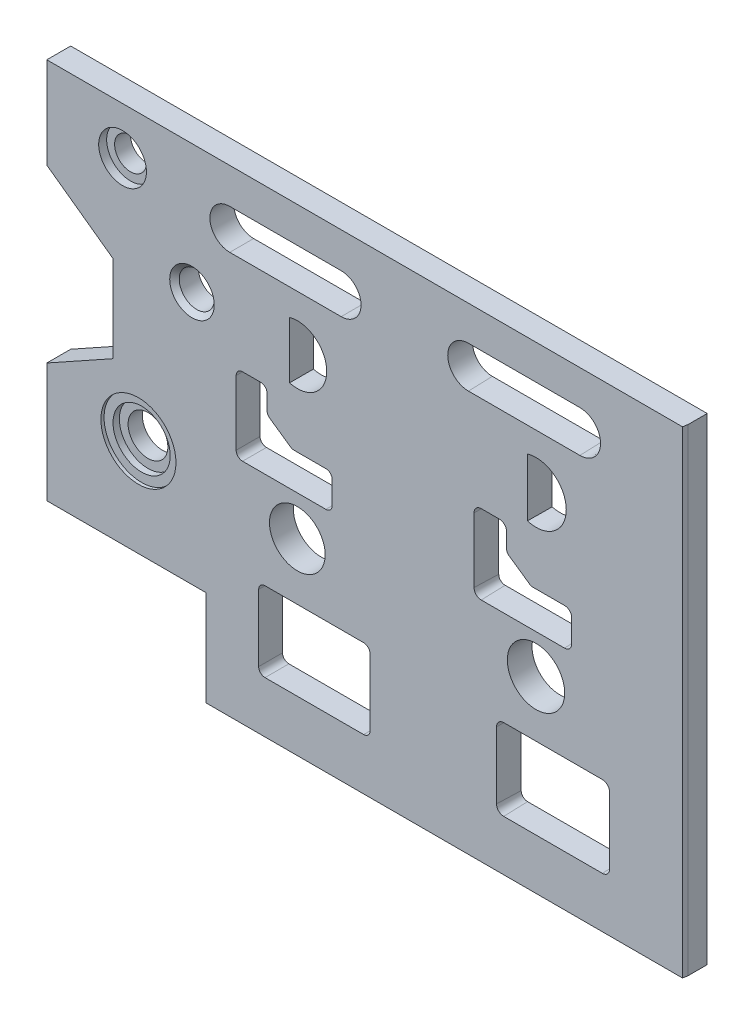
from build123d import *

# Parameters (mm, degrees)
SKETCH1_W                    = 400
SKETCH1_H                    = 300
BASE_EXTRUDE_DEPTH           = 15
SKETCH3_W                    = 100
SKETCH3_H                    = 60
CUT_EXTRUDE1_DEPTH           = 15
SKETCH5_R                    = 17.5
CUT_EXTRUDE2_DEPTH           = 15
SKETCH9_R                    = 17.5
CUT_EXTRUDE3_DEPTH           = 15
CUT_EXTRUDE3_DRAFT           = 2
CUT_EXTRUDE3_PROFILE_2_DEPTH = 15
CUT_EXTRUDE3_PROFILE_2_DRAFT = 2
CUT_EXTRUDE3_PROFILE_3_DEPTH = 15
CUT_EXTRUDE3_PROFILE_3_DRAFT = 2
CUT_EXTRUDE3_PROFILE_4_DEPTH = 15
CUT_EXTRUDE3_PROFILE_4_DRAFT = 2
CUT_EXTRUDE3_PROFILE_5_DEPTH = 15
CUT_EXTRUDE3_PROFILE_5_DRAFT = 2
SKETCH10_R                   = 10
SKETCH10_R_2                 = 11
CUT_EXTRUDE4_DEPTH           = 15
SKETCH11_R                   = 12.5
CUT_EXTRUDE5_DEPTH           = 15
SKETCH12_R                   = 15
CUT_EXTRUDE6_DEPTH           = 5
CHAMFER1_SIZE                = 3
SKETCH13_R                   = 17.970132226
CUT_EXTRUDE7_DEPTH           = 6
SKETCH14_R                   = 23.588666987
CUT_EXTRUDE8_DEPTH           = 2
CHAMFER2_SIZE                = 0.528980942
CHAMFER2_SIZE2               = 3


with BuildPart() as part:
    # Sketch1 → Base-Extrude (new body)
    with BuildSketch(Plane.XY):
        with Locations((200, 150)):
            Rectangle(SKETCH1_W, SKETCH1_H)
    extrude(amount=BASE_EXTRUDE_DEPTH)

    # Sketch3 → Cut-Extrude1 (cut)
    with BuildSketch(Plane(origin=(0, 0, 0), x_dir=(-1, 0, 0), z_dir=(0, 0, -1))):
        Polygon((0, 134.976525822), (-41.627543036, 158.13771518), (-41.627543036, 212.597809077), (0, 242.644757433), align=None)
        with Locations((-50, 30)):
            Rectangle(SKETCH3_W, SKETCH3_H)
    extrude(amount=-CUT_EXTRUDE1_DEPTH, mode=Mode.SUBTRACT)

    # Sketch5 → Cut-Extrude2 (cut)
    with BuildSketch(Plane(origin=(0, 0, 0), x_dir=(-1, 0, 0), z_dir=(0, 0, -1))):
        with Locations((-157.434743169, 118.075117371)):
            Circle(SKETCH5_R)
        with BuildLine():
            Line((-119.004694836, 187.704225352), (-119.004694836, 147.015649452))
            ThreePointArc((-119.004694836, 147.015649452), (-120.176267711, 144.187222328), (-123.004694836, 143.015649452))
            Line((-123.004694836, 143.015649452), (-175.342723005, 143.015649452))
            ThreePointArc((-175.342723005, 143.015649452), (-178.171150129, 144.187222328), (-179.342723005, 147.015649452))
            Line((-179.342723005, 147.015649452), (-179.342723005, 161.169014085))
            ThreePointArc((-179.342723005, 161.169014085), (-178.171150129, 163.997441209), (-175.342723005, 165.169014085))
            Line((-175.342723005, 165.169014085), (-155.434743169, 165.169014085))
            ThreePointArc((-155.434743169, 165.169014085), (-154.237764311, 165.352308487), (-153.150485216, 165.885393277))
            Line((-153.150485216, 165.885393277), (-140.125757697, 174.946073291))
            ThreePointArc((-140.125757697, 174.946073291), (-138.864805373, 176.377267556), (-138.410015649, 178.229694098))
            Line((-138.410015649, 178.229694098), (-138.410015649, 187.704225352))
            ThreePointArc((-138.410015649, 187.704225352), (-137.238442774, 190.532652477), (-134.410015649, 191.704225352))
            Line((-134.410015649, 191.704225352), (-123.004694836, 191.704225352))
            ThreePointArc((-123.004694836, 191.704225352), (-120.176267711, 190.532652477), (-119.004694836, 187.704225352))
        make_face()
        with BuildLine():
            Line((-137.129890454, 82.316118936), (-199.129890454, 82.316118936))
            ThreePointArc((-199.129890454, 82.316118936), (-201.958317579, 81.144546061), (-203.129890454, 78.316118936))
            Line((-203.129890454, 78.316118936), (-203.129890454, 36.316118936))
            ThreePointArc((-203.129890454, 36.316118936), (-201.958317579, 33.487691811), (-199.129890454, 32.316118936))
            Line((-199.129890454, 32.316118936), (-137.129890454, 32.316118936))
            ThreePointArc((-137.129890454, 32.316118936), (-134.301463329, 33.487691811), (-133.129890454, 36.316118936))
            Line((-133.129890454, 36.316118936), (-133.129890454, 78.316118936))
            ThreePointArc((-133.129890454, 78.316118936), (-134.301463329, 81.144546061), (-137.129890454, 82.316118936))
        make_face()
        with BuildLine():
            Line((-152.547730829, 236.089494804), (-152.547730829, 200.436326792))
            ThreePointArc((-152.547730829, 200.436326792), (-175.919060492, 218.262910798), (-152.547730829, 236.089494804))
        make_face()
        with BuildLine():
            Line((-114.976525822, 277.699530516), (-184.976525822, 277.699530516))
            ThreePointArc((-184.976525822, 277.699530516), (-197.476525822, 265.199530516), (-184.976525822, 252.699530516))
            Line((-184.976525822, 252.699530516), (-114.976525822, 252.699530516))
            ThreePointArc((-114.976525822, 252.699530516), (-102.476525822, 265.199530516), (-114.976525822, 277.699530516))
        make_face()
    extrude(amount=-CUT_EXTRUDE2_DEPTH, mode=Mode.SUBTRACT)


with BuildPart() as cut_extrude3_tool:
    # Sketch9 → Cut-Extrude3 (with draft: the straight prism first)
    with BuildSketch(Plane(origin=(8.022369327, 31.352349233, 0), x_dir=(-1, 0, 0), z_dir=(0, 0, -1))):
        with Locations((-299.412373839, 86.722768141)):
            Circle(SKETCH9_R)
    extrude(amount=-CUT_EXTRUDE3_DEPTH)
    # Cut-Extrude3: the draft: its side faces are tilted about the plane it starts from
    cut_extrude3_sides = [cut_extrude3_tool.faces().sort_by_distance(p)[0] for p in [
        (324.934743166, 118.075117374, 7.5),
    ]]
    draft(cut_extrude3_sides, Plane(origin=(8.022369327, 31.352349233, 0), x_dir=(-1, 0, 0), z_dir=(0, 0, -1)), CUT_EXTRUDE3_DRAFT)


with BuildPart() as part_1:
    add(part.part)

    # Cut-Extrude3: cut by cut_extrude3_tool
    add(cut_extrude3_tool.part, mode=Mode.SUBTRACT)


with BuildPart() as cut_extrude3_profile_2_tool:
    # Sketch9 → Cut-Extrude3 profile 2 (with draft: the straight prism first)
    with BuildSketch(Plane(origin=(8.022369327, 31.352349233, 0), x_dir=(-1, 0, 0), z_dir=(0, 0, -1))):
        with BuildLine():
            ThreePointArc((-260.982325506, 156.351876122), (-262.153898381, 159.180303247), (-264.982325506, 160.351876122))
            Line((-264.982325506, 160.351876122), (-276.387646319, 160.351876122))
            ThreePointArc((-276.387646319, 160.351876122), (-279.216073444, 159.180303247), (-280.387646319, 156.351876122))
            Line((-280.387646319, 156.351876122), (-280.387646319, 146.877344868))
            ThreePointArc((-280.387646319, 146.877344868), (-280.842436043, 145.024918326), (-282.103388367, 143.593724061))
            Line((-282.103388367, 143.593724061), (-295.128115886, 134.533044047))
            ThreePointArc((-295.128115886, 134.533044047), (-296.215394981, 133.999959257), (-297.412373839, 133.816664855))
            Line((-297.412373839, 133.816664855), (-317.320353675, 133.816664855))
            ThreePointArc((-317.320353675, 133.816664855), (-320.148780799, 132.645091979), (-321.320353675, 129.816664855))
            Line((-321.320353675, 129.816664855), (-321.320353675, 115.663300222))
            ThreePointArc((-321.320353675, 115.663300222), (-320.148780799, 112.834873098), (-317.320353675, 111.663300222))
            Line((-317.320353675, 111.663300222), (-264.982325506, 111.663300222))
            ThreePointArc((-264.982325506, 111.663300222), (-262.153898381, 112.834873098), (-260.982325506, 115.663300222))
            Line((-260.982325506, 115.663300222), (-260.982325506, 156.351876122))
        make_face()
    extrude(amount=-CUT_EXTRUDE3_PROFILE_2_DEPTH)
    # Cut-Extrude3 profile 2: the draft: its side faces are tilted about the plane it starts from
    cut_extrude3_profile_2_sides = [cut_extrude3_profile_2_tool.faces().sort_by_distance(p)[0] for p in [
        (270.176267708, 190.53265248, 7.5),
        (278.70735524, 191.704225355, 7.5),
        (287.238442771, 190.53265248, 7.5),
        (288.410015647, 182.966959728, 7.5),
        (288.86480537, 176.377267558, 7.5),
        (296.638121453, 170.415733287, 7.5),
        (304.237764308, 165.35230849, 7.5),
        (315.388733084, 165.169014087, 7.5),
        (328.171150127, 163.997441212, 7.5),
        (329.342723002, 154.092331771, 7.5),
        (328.171150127, 144.18722233, 7.5),
        (299.173708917, 143.015649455, 7.5),
        (270.176267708, 144.18722233, 7.5),
        (269.004694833, 167.359937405, 7.5),
    ]]
    draft(cut_extrude3_profile_2_sides, Plane(origin=(8.022369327, 31.352349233, 0), x_dir=(-1, 0, 0), z_dir=(0, 0, -1)), CUT_EXTRUDE3_PROFILE_2_DRAFT)


with BuildPart() as part_2:
    add(part_1.part)

    # Cut-Extrude3 profile 2: cut by cut_extrude3_profile_2_tool
    add(cut_extrude3_profile_2_tool.part, mode=Mode.SUBTRACT)


with BuildPart() as cut_extrude3_profile_3_tool:
    # Sketch9 → Cut-Extrude3 profile 3 (with draft: the straight prism first)
    with BuildSketch(Plane(origin=(8.022369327, 31.352349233, 0), x_dir=(-1, 0, 0), z_dir=(0, 0, -1))):
        with BuildLine():
            Line((-279.107521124, 50.963769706), (-341.107521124, 50.963769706))
            ThreePointArc((-341.107521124, 50.963769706), (-343.935948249, 49.792196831), (-345.107521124, 46.963769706))
            Line((-345.107521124, 46.963769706), (-345.107521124, 4.963769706))
            ThreePointArc((-345.107521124, 4.963769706), (-343.935948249, 2.135342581), (-341.107521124, 0.963769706))
            Line((-341.107521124, 0.963769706), (-279.107521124, 0.963769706))
            ThreePointArc((-279.107521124, 0.963769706), (-276.279093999, 2.135342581), (-275.107521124, 4.963769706))
            Line((-275.107521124, 4.963769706), (-275.107521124, 46.963769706))
            ThreePointArc((-275.107521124, 46.963769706), (-276.279093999, 49.792196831), (-279.107521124, 50.963769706))
        make_face()
    extrude(amount=-CUT_EXTRUDE3_PROFILE_3_DEPTH)
    # Cut-Extrude3 profile 3: the draft: its side faces are tilted about the plane it starts from
    cut_extrude3_profile_3_sides = [cut_extrude3_profile_3_tool.faces().sort_by_distance(p)[0] for p in [
        (318.129890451, 82.316118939, 7.5),
        (351.958317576, 81.144546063, 7.5),
        (353.129890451, 57.316118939, 7.5),
        (351.958317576, 33.487691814, 7.5),
        (318.129890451, 32.316118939, 7.5),
        (284.301463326, 33.487691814, 7.5),
        (283.129890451, 57.316118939, 7.5),
        (284.301463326, 81.144546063, 7.5),
    ]]
    draft(cut_extrude3_profile_3_sides, Plane(origin=(8.022369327, 31.352349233, 0), x_dir=(-1, 0, 0), z_dir=(0, 0, -1)), CUT_EXTRUDE3_PROFILE_3_DRAFT)


with BuildPart() as part_3:
    add(part_2.part)

    # Cut-Extrude3 profile 3: cut by cut_extrude3_profile_3_tool
    add(cut_extrude3_profile_3_tool.part, mode=Mode.SUBTRACT)


with BuildPart() as cut_extrude3_profile_4_tool:
    # Sketch9 → Cut-Extrude3 profile 4 (with draft: the straight prism first)
    with BuildSketch(Plane(origin=(8.022369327, 31.352349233, 0), x_dir=(-1, 0, 0), z_dir=(0, 0, -1))):
        with BuildLine():
            ThreePointArc((-294.525361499, 204.737145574), (-317.896691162, 186.910561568), (-294.525361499, 169.083977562))
            Line((-294.525361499, 169.083977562), (-294.525361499, 204.737145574))
        make_face()
    extrude(amount=-CUT_EXTRUDE3_PROFILE_4_DEPTH)
    # Cut-Extrude3 profile 4: the draft: its side faces are tilted about the plane it starts from
    cut_extrude3_profile_4_sides = [cut_extrude3_profile_4_tool.faces().sort_by_distance(p)[0] for p in [
        (325.91906049, 218.262910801, 7.5),
        (302.547730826, 218.262910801, 7.5),
    ]]
    draft(cut_extrude3_profile_4_sides, Plane(origin=(8.022369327, 31.352349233, 0), x_dir=(-1, 0, 0), z_dir=(0, 0, -1)), CUT_EXTRUDE3_PROFILE_4_DRAFT)


with BuildPart() as part_4:
    add(part_3.part)

    # Cut-Extrude3 profile 4: cut by cut_extrude3_profile_4_tool
    add(cut_extrude3_profile_4_tool.part, mode=Mode.SUBTRACT)


with BuildPart() as cut_extrude3_profile_5_tool:
    # Sketch9 → Cut-Extrude3 profile 5 (with draft: the straight prism first)
    with BuildSketch(Plane(origin=(8.022369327, 31.352349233, 0), x_dir=(-1, 0, 0), z_dir=(0, 0, -1))):
        with BuildLine():
            Line((-256.954156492, 246.347181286), (-326.954156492, 246.347181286))
            ThreePointArc((-326.954156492, 246.347181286), (-339.454156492, 233.847181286), (-326.954156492, 221.347181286))
            Line((-326.954156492, 221.347181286), (-256.954156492, 221.347181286))
            ThreePointArc((-256.954156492, 221.347181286), (-244.454156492, 233.847181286), (-256.954156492, 246.347181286))
        make_face()
    extrude(amount=-CUT_EXTRUDE3_PROFILE_5_DEPTH)
    # Cut-Extrude3 profile 5: the draft: its side faces are tilted about the plane it starts from
    cut_extrude3_profile_5_sides = [cut_extrude3_profile_5_tool.faces().sort_by_distance(p)[0] for p in [
        (299.976525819, 277.699530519, 7.5),
        (347.476525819, 265.199530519, 7.5),
        (299.976525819, 252.699530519, 7.5),
        (252.476525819, 265.199530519, 7.5),
    ]]
    draft(cut_extrude3_profile_5_sides, Plane(origin=(8.022369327, 31.352349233, 0), x_dir=(-1, 0, 0), z_dir=(0, 0, -1)), CUT_EXTRUDE3_PROFILE_5_DRAFT)


with BuildPart() as part_5:
    add(part_4.part)

    # Cut-Extrude3 profile 5: cut by cut_extrude3_profile_5_tool
    add(cut_extrude3_profile_5_tool.part, mode=Mode.SUBTRACT)

    # Sketch10 → Cut-Extrude4 (cut)
    with BuildSketch(Plane.XY.offset(15)):
        with Locations((47.592332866, 270.305438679)):
            Circle(SKETCH10_R)
        with Locations((91.226429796, 219.191210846)):
            Circle(SKETCH10_R_2)
    extrude(amount=-CUT_EXTRUDE4_DEPTH, mode=Mode.SUBTRACT)

    # Sketch11 → Cut-Extrude5 (cut)
    with BuildSketch(Plane.XY.offset(15)):
        with Locations((57.565840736, 121.326164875)):
            Circle(SKETCH11_R)
    extrude(amount=-CUT_EXTRUDE5_DEPTH, mode=Mode.SUBTRACT)

    # Sketch12 → Cut-Extrude6 (cut)
    with BuildSketch(Plane.XY.offset(15)):
        with Locations((47.592332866, 270.305438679)):
            Circle(SKETCH12_R)
    extrude(amount=-CUT_EXTRUDE6_DEPTH, mode=Mode.SUBTRACT)

    # Chamfer1
    chamfer1_edges = [part_5.edges().sort_by_distance(p)[0] for p in [
        (80.226429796, 219.191210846, 15),
    ]]
    chamfer(chamfer1_edges, length=CHAMFER1_SIZE)

    # Sketch13 → Cut-Extrude7 (cut)
    with BuildSketch(Plane.XY.offset(15)):
        with Locations((57.565840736, 121.326164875)):
            Circle(SKETCH13_R)
    extrude(amount=-CUT_EXTRUDE7_DEPTH, mode=Mode.SUBTRACT)

    # Sketch14 → Cut-Extrude8 (cut)
    with BuildSketch(Plane.XY.offset(15)):
        with Locations((57.565840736, 121.326164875)):
            Circle(SKETCH14_R)
    extrude(amount=-CUT_EXTRUDE8_DEPTH, mode=Mode.SUBTRACT)

    # Chamfer2
    chamfer2_edges = [part_5.edges().sort_by_distance(p)[0] for p in [
        (400, 150, 15),
    ]]
    chamfer2_side = [part_5.faces().sort_by_distance(p)[0] for p in [
        (214.557097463, 156.358484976, 15),
    ]]
    chamfer(chamfer2_edges, length=CHAMFER2_SIZE, length2=CHAMFER2_SIZE2, reference=chamfer2_side[0])


solid = part_5.part
